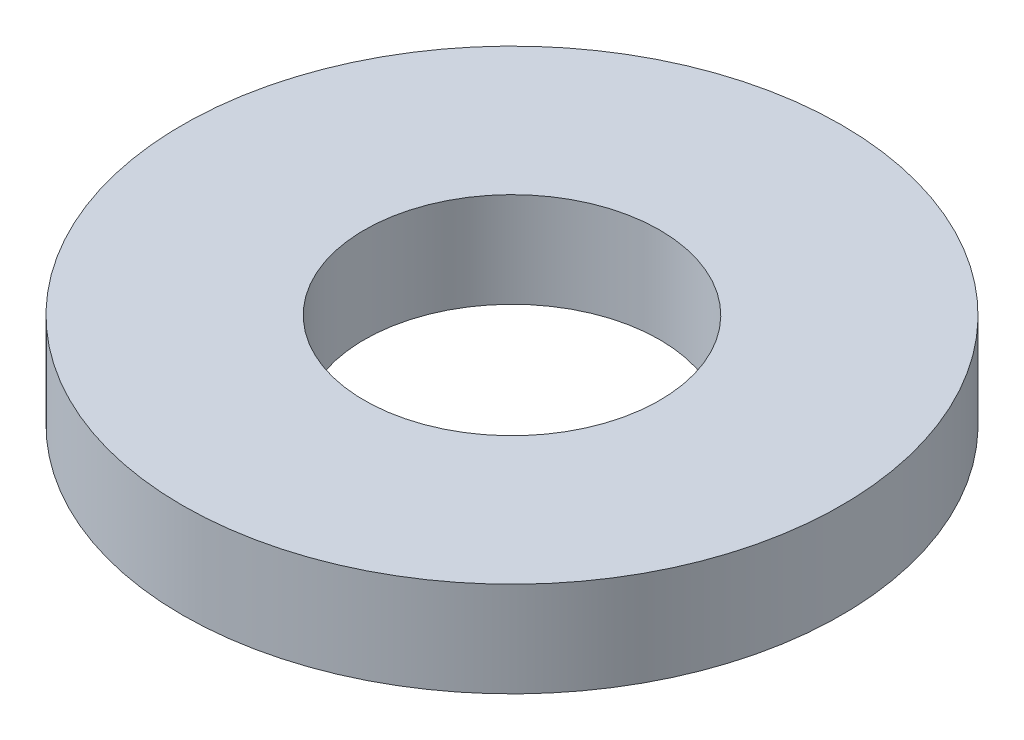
ISO-10303-21;
HEADER;
FILE_DESCRIPTION(('STEP AP214'),'2;1');
FILE_NAME('part.step','',(''),(''),'','','');
FILE_SCHEMA(('AUTOMOTIVE_DESIGN { 1 0 10303 214 1 1 1 1 }'));
ENDSEC;
DATA;
#1=APPLICATION_CONTEXT('core data for automotive mechanical design processes');
#2=APPLICATION_PROTOCOL_DEFINITION('international standard','automotive_design',2000,#1);
#3=PRODUCT_CONTEXT('',#1,'mechanical');
#4=PRODUCT('Part','Part','',(#3));
#5=PRODUCT_RELATED_PRODUCT_CATEGORY('part','',(#4));
#6=PRODUCT_DEFINITION_FORMATION('','',#4);
#7=PRODUCT_DEFINITION_CONTEXT('part definition',#1,'design');
#8=PRODUCT_DEFINITION('design','',#6,#7);
#9=PRODUCT_DEFINITION_SHAPE('','',#8);
#10=(LENGTH_UNIT() NAMED_UNIT(*) SI_UNIT(.MILLI.,.METRE.));
#11=(NAMED_UNIT(*) PLANE_ANGLE_UNIT() SI_UNIT($,.RADIAN.));
#12=(NAMED_UNIT(*) SI_UNIT($,.STERADIAN.) SOLID_ANGLE_UNIT());
#13=UNCERTAINTY_MEASURE_WITH_UNIT(LENGTH_MEASURE(1.E-05),#10,'distance_accuracy_value','');
#14=(GEOMETRIC_REPRESENTATION_CONTEXT(3) GLOBAL_UNCERTAINTY_ASSIGNED_CONTEXT((#13)) GLOBAL_UNIT_ASSIGNED_CONTEXT((#10,
#11,#12)) REPRESENTATION_CONTEXT('',''));
#15=CARTESIAN_POINT('',(0.,0.,0.));
#16=DIRECTION('',(0.,0.,1.));
#17=DIRECTION('',(1.,0.,0.));
#18=AXIS2_PLACEMENT_3D('',#15,#16,#17);
#19=CARTESIAN_POINT('',(0.,1.02108,0.));
#20=DIRECTION('',(0.,-1.,0.));
#21=DIRECTION('',(0.,0.,-1.));
#22=AXIS2_PLACEMENT_3D('',#19,#20,#21);
#23=CYLINDRICAL_SURFACE('',#22,3.5433);
#24=CARTESIAN_POINT('',(0.,1.02108,0.));
#25=DIRECTION('',(0.,1.,0.));
#26=DIRECTION('',(0.,0.,1.));
#27=AXIS2_PLACEMENT_3D('',#24,#25,#26);
#28=CIRCLE('',#27,3.5433);
#29=CARTESIAN_POINT('',(0.,1.02108,-3.5433));
#30=VERTEX_POINT('',#29);
#31=EDGE_CURVE('E10',#30,#30,#28,.T.);
#32=CARTESIAN_POINT('',(0.,0.,0.));
#33=DIRECTION('',(0.,1.,0.));
#34=DIRECTION('',(0.,0.,1.));
#35=AXIS2_PLACEMENT_3D('',#32,#33,#34);
#36=CIRCLE('',#35,3.5433);
#37=CARTESIAN_POINT('',(0.,0.,-3.5433));
#38=VERTEX_POINT('',#37);
#39=EDGE_CURVE('E34',#38,#38,#36,.T.);
#40=CARTESIAN_POINT('',(0.,1.02108,-3.5433));
#41=CARTESIAN_POINT('',(0.,1.01044375,-3.5433));
#42=CARTESIAN_POINT('',(0.,0.9998075,-3.5433));
#43=CARTESIAN_POINT('',(0.,0.978535,-3.5433));
#44=CARTESIAN_POINT('',(0.,0.96789875,-3.5433));
#45=CARTESIAN_POINT('',(0.,0.94662625,-3.5433));
#46=CARTESIAN_POINT('',(0.,0.93599,-3.5433));
#47=CARTESIAN_POINT('',(0.,0.9147175,-3.5433));
#48=CARTESIAN_POINT('',(0.,0.90408125,-3.5433));
#49=CARTESIAN_POINT('',(0.,0.88280875,-3.5433));
#50=CARTESIAN_POINT('',(0.,0.8721725,-3.5433));
#51=CARTESIAN_POINT('',(0.,0.8509,-3.5433));
#52=CARTESIAN_POINT('',(0.,0.84026375,-3.5433));
#53=CARTESIAN_POINT('',(0.,0.81899125,-3.5433));
#54=CARTESIAN_POINT('',(0.,0.808355,-3.5433));
#55=CARTESIAN_POINT('',(0.,0.7870825,-3.5433));
#56=CARTESIAN_POINT('',(0.,0.77644625,-3.5433));
#57=CARTESIAN_POINT('',(0.,0.75517375,-3.5433));
#58=CARTESIAN_POINT('',(0.,0.7445375,-3.5433));
#59=CARTESIAN_POINT('',(0.,0.723265,-3.5433));
#60=CARTESIAN_POINT('',(0.,0.71262875,-3.5433));
#61=CARTESIAN_POINT('',(0.,0.69135625,-3.5433));
#62=CARTESIAN_POINT('',(0.,0.68072,-3.5433));
#63=CARTESIAN_POINT('',(0.,0.6594475,-3.5433));
#64=CARTESIAN_POINT('',(0.,0.64881125,-3.5433));
#65=CARTESIAN_POINT('',(0.,0.62753875,-3.5433));
#66=CARTESIAN_POINT('',(0.,0.6169025,-3.5433));
#67=CARTESIAN_POINT('',(0.,0.59563,-3.5433));
#68=CARTESIAN_POINT('',(0.,0.58499375,-3.5433));
#69=CARTESIAN_POINT('',(0.,0.56372125,-3.5433));
#70=CARTESIAN_POINT('',(0.,0.553085,-3.5433));
#71=CARTESIAN_POINT('',(0.,0.5318125,-3.5433));
#72=CARTESIAN_POINT('',(0.,0.52117625,-3.5433));
#73=CARTESIAN_POINT('',(0.,0.49990375,-3.5433));
#74=CARTESIAN_POINT('',(0.,0.4892675,-3.5433));
#75=CARTESIAN_POINT('',(0.,0.467995,-3.5433));
#76=CARTESIAN_POINT('',(0.,0.45735875,-3.5433));
#77=CARTESIAN_POINT('',(0.,0.43608625,-3.5433));
#78=CARTESIAN_POINT('',(0.,0.42545,-3.5433));
#79=CARTESIAN_POINT('',(0.,0.4041775,-3.5433));
#80=CARTESIAN_POINT('',(0.,0.39354125,-3.5433));
#81=CARTESIAN_POINT('',(0.,0.37226875,-3.5433));
#82=CARTESIAN_POINT('',(0.,0.3616325,-3.5433));
#83=CARTESIAN_POINT('',(0.,0.34036,-3.5433));
#84=CARTESIAN_POINT('',(0.,0.32972375,-3.5433));
#85=CARTESIAN_POINT('',(0.,0.30845125,-3.5433));
#86=CARTESIAN_POINT('',(0.,0.297815,-3.5433));
#87=CARTESIAN_POINT('',(0.,0.2765425,-3.5433));
#88=CARTESIAN_POINT('',(0.,0.26590625,-3.5433));
#89=CARTESIAN_POINT('',(0.,0.24463375,-3.5433));
#90=CARTESIAN_POINT('',(0.,0.2339975,-3.5433));
#91=CARTESIAN_POINT('',(0.,0.212725,-3.5433));
#92=CARTESIAN_POINT('',(0.,0.20208875,-3.5433));
#93=CARTESIAN_POINT('',(0.,0.18081625,-3.5433));
#94=CARTESIAN_POINT('',(0.,0.17018,-3.5433));
#95=CARTESIAN_POINT('',(0.,0.1489075,-3.5433));
#96=CARTESIAN_POINT('',(0.,0.13827125,-3.5433));
#97=CARTESIAN_POINT('',(0.,0.11699875,-3.5433));
#98=CARTESIAN_POINT('',(0.,0.1063625,-3.5433));
#99=CARTESIAN_POINT('',(0.,0.0850899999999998,-3.5433));
#100=CARTESIAN_POINT('',(0.,0.0744537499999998,-3.5433));
#101=CARTESIAN_POINT('',(0.,0.0531812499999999,-3.5433));
#102=CARTESIAN_POINT('',(0.,0.042545,-3.5433));
#103=CARTESIAN_POINT('',(0.,0.0212725,-3.5433));
#104=CARTESIAN_POINT('',(0.,0.01063625,-3.5433));
#105=CARTESIAN_POINT('',(0.,0.,-3.5433));
#106=B_SPLINE_CURVE_WITH_KNOTS('',3,(#40,#41,#42,#43,#44,#45,#46,#47,#48,#49,#50,#51,#52,#53,
#54,#55,#56,#57,#58,#59,#60,#61,#62,#63,#64,#65,#66,#67,#68,#69,#70,#71,#72,#73,#74,#75,#76,#77,
#78,#79,#80,#81,#82,#83,#84,#85,#86,#87,#88,#89,#90,#91,#92,#93,#94,#95,#96,#97,#98,#99,#100,
#101,#102,#103,#104,#105),.UNSPECIFIED.,.F.,.F.,(4,2,2,2,2,2,2,2,2,2,2,2,2,2,2,2,2,2,2,2,2,2,2,
2,2,2,2,2,2,2,2,2,4),(0.,0.03190875,0.0638175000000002,0.0957262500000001,0.127635,0.15954375,
0.1914525,0.22336125,0.25527,0.28717875,0.3190875,0.35099625,0.382905,0.41481375,0.4467225,
0.47863125,0.51054,0.54244875,0.5743575,0.60626625,0.638175,0.67008375,0.7019925,0.73390125,
0.76581,0.79771875,0.8296275,0.86153625,0.893445,0.92535375,0.9572625,0.98917125,1.02108),.UNSPECIFIED.);
#107=EDGE_CURVE('BSEAM28',#30,#38,#106,.T.);
#108=ORIENTED_EDGE('',*,*,#31,.F.);
#109=ORIENTED_EDGE('',*,*,#39,.T.);
#110=ORIENTED_EDGE('',*,*,#107,.T.);
#111=ORIENTED_EDGE('',*,*,#107,.F.);
#112=EDGE_LOOP('',(#108,#110,#109,#111));
#113=FACE_BOUND('',#112,.T.);
#114=ADVANCED_FACE('F28',(#113),#23,.T.);
#115=CARTESIAN_POINT('',(0.,1.02108,0.));
#116=DIRECTION('',(0.,1.,0.));
#117=DIRECTION('',(0.,0.,1.));
#118=AXIS2_PLACEMENT_3D('',#115,#116,#117);
#119=PLANE('',#118);
#120=CARTESIAN_POINT('',(0.,1.02108,0.));
#121=DIRECTION('',(0.,-1.,0.));
#122=DIRECTION('',(0.,0.,-1.));
#123=AXIS2_PLACEMENT_3D('',#120,#121,#122);
#124=CIRCLE('',#123,1.5875);
#125=CARTESIAN_POINT('',(0.,1.02108,-1.5875));
#126=VERTEX_POINT('',#125);
#127=EDGE_CURVE('E38',#126,#126,#124,.T.);
#128=ORIENTED_EDGE('',*,*,#127,.T.);
#129=EDGE_LOOP('',(#128));
#130=FACE_BOUND('',#129,.T.);
#131=ORIENTED_EDGE('',*,*,#31,.T.);
#132=EDGE_LOOP('',(#131));
#133=FACE_BOUND('',#132,.T.);
#134=ADVANCED_FACE('F53',(#130,#133),#119,.T.);
#135=CARTESIAN_POINT('',(0.,0.,0.));
#136=DIRECTION('',(0.,1.,0.));
#137=DIRECTION('',(0.,0.,1.));
#138=AXIS2_PLACEMENT_3D('',#135,#136,#137);
#139=PLANE('',#138);
#140=CARTESIAN_POINT('',(0.,0.,0.));
#141=DIRECTION('',(0.,-1.,0.));
#142=DIRECTION('',(0.,0.,-1.));
#143=AXIS2_PLACEMENT_3D('',#140,#141,#142);
#144=CIRCLE('',#143,1.5875);
#145=CARTESIAN_POINT('',(0.,0.,-1.5875));
#146=VERTEX_POINT('',#145);
#147=EDGE_CURVE('E42',#146,#146,#144,.T.);
#148=ORIENTED_EDGE('',*,*,#147,.F.);
#149=EDGE_LOOP('',(#148));
#150=FACE_BOUND('',#149,.T.);
#151=ORIENTED_EDGE('',*,*,#39,.F.);
#152=EDGE_LOOP('',(#151));
#153=FACE_BOUND('',#152,.T.);
#154=ADVANCED_FACE('F50',(#150,#153),#139,.F.);
#155=CARTESIAN_POINT('',(0.,1.02108,0.));
#156=DIRECTION('',(0.,-1.,0.));
#157=DIRECTION('',(0.,0.,-1.));
#158=AXIS2_PLACEMENT_3D('',#155,#156,#157);
#159=CYLINDRICAL_SURFACE('',#158,1.5875);
#160=CARTESIAN_POINT('',(0.,1.02108,-1.5875));
#161=CARTESIAN_POINT('',(0.,1.01044375,-1.5875));
#162=CARTESIAN_POINT('',(0.,0.9998075,-1.5875));
#163=CARTESIAN_POINT('',(0.,0.978535,-1.5875));
#164=CARTESIAN_POINT('',(0.,0.96789875,-1.5875));
#165=CARTESIAN_POINT('',(0.,0.94662625,-1.5875));
#166=CARTESIAN_POINT('',(0.,0.93599,-1.5875));
#167=CARTESIAN_POINT('',(0.,0.9147175,-1.5875));
#168=CARTESIAN_POINT('',(0.,0.90408125,-1.5875));
#169=CARTESIAN_POINT('',(0.,0.88280875,-1.5875));
#170=CARTESIAN_POINT('',(0.,0.8721725,-1.5875));
#171=CARTESIAN_POINT('',(0.,0.8509,-1.5875));
#172=CARTESIAN_POINT('',(0.,0.84026375,-1.5875));
#173=CARTESIAN_POINT('',(0.,0.81899125,-1.5875));
#174=CARTESIAN_POINT('',(0.,0.808355,-1.5875));
#175=CARTESIAN_POINT('',(0.,0.7870825,-1.5875));
#176=CARTESIAN_POINT('',(0.,0.77644625,-1.5875));
#177=CARTESIAN_POINT('',(0.,0.75517375,-1.5875));
#178=CARTESIAN_POINT('',(0.,0.7445375,-1.5875));
#179=CARTESIAN_POINT('',(0.,0.723265,-1.5875));
#180=CARTESIAN_POINT('',(0.,0.71262875,-1.5875));
#181=CARTESIAN_POINT('',(0.,0.69135625,-1.5875));
#182=CARTESIAN_POINT('',(0.,0.68072,-1.5875));
#183=CARTESIAN_POINT('',(0.,0.6594475,-1.5875));
#184=CARTESIAN_POINT('',(0.,0.64881125,-1.5875));
#185=CARTESIAN_POINT('',(0.,0.62753875,-1.5875));
#186=CARTESIAN_POINT('',(0.,0.6169025,-1.5875));
#187=CARTESIAN_POINT('',(0.,0.59563,-1.5875));
#188=CARTESIAN_POINT('',(0.,0.58499375,-1.5875));
#189=CARTESIAN_POINT('',(0.,0.56372125,-1.5875));
#190=CARTESIAN_POINT('',(0.,0.553085,-1.5875));
#191=CARTESIAN_POINT('',(0.,0.5318125,-1.5875));
#192=CARTESIAN_POINT('',(0.,0.52117625,-1.5875));
#193=CARTESIAN_POINT('',(0.,0.49990375,-1.5875));
#194=CARTESIAN_POINT('',(0.,0.4892675,-1.5875));
#195=CARTESIAN_POINT('',(0.,0.467995,-1.5875));
#196=CARTESIAN_POINT('',(0.,0.45735875,-1.5875));
#197=CARTESIAN_POINT('',(0.,0.43608625,-1.5875));
#198=CARTESIAN_POINT('',(0.,0.42545,-1.5875));
#199=CARTESIAN_POINT('',(0.,0.4041775,-1.5875));
#200=CARTESIAN_POINT('',(0.,0.39354125,-1.5875));
#201=CARTESIAN_POINT('',(0.,0.37226875,-1.5875));
#202=CARTESIAN_POINT('',(0.,0.3616325,-1.5875));
#203=CARTESIAN_POINT('',(0.,0.34036,-1.5875));
#204=CARTESIAN_POINT('',(0.,0.32972375,-1.5875));
#205=CARTESIAN_POINT('',(0.,0.30845125,-1.5875));
#206=CARTESIAN_POINT('',(0.,0.297815,-1.5875));
#207=CARTESIAN_POINT('',(0.,0.2765425,-1.5875));
#208=CARTESIAN_POINT('',(0.,0.26590625,-1.5875));
#209=CARTESIAN_POINT('',(0.,0.24463375,-1.5875));
#210=CARTESIAN_POINT('',(0.,0.2339975,-1.5875));
#211=CARTESIAN_POINT('',(0.,0.212725,-1.5875));
#212=CARTESIAN_POINT('',(0.,0.20208875,-1.5875));
#213=CARTESIAN_POINT('',(0.,0.18081625,-1.5875));
#214=CARTESIAN_POINT('',(0.,0.17018,-1.5875));
#215=CARTESIAN_POINT('',(0.,0.1489075,-1.5875));
#216=CARTESIAN_POINT('',(0.,0.13827125,-1.5875));
#217=CARTESIAN_POINT('',(0.,0.11699875,-1.5875));
#218=CARTESIAN_POINT('',(0.,0.1063625,-1.5875));
#219=CARTESIAN_POINT('',(0.,0.0850900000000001,-1.5875));
#220=CARTESIAN_POINT('',(0.,0.07445375,-1.5875));
#221=CARTESIAN_POINT('',(0.,0.05318125,-1.5875));
#222=CARTESIAN_POINT('',(0.,0.042545,-1.5875));
#223=CARTESIAN_POINT('',(0.,0.0212725,-1.5875));
#224=CARTESIAN_POINT('',(0.,0.01063625,-1.5875));
#225=CARTESIAN_POINT('',(0.,0.,-1.5875));
#226=B_SPLINE_CURVE_WITH_KNOTS('',3,(#160,#161,#162,#163,#164,#165,#166,#167,#168,#169,#170,
#171,#172,#173,#174,#175,#176,#177,#178,#179,#180,#181,#182,#183,#184,#185,#186,#187,#188,#189,
#190,#191,#192,#193,#194,#195,#196,#197,#198,#199,#200,#201,#202,#203,#204,#205,#206,#207,#208,
#209,#210,#211,#212,#213,#214,#215,#216,#217,#218,#219,#220,#221,#222,#223,#224,#225),
.UNSPECIFIED.,.F.,.F.,(4,2,2,2,2,2,2,2,2,2,2,2,2,2,2,2,2,2,2,2,2,2,2,2,2,2,2,2,2,2,2,2,4),(0.,
0.0319087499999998,0.0638174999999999,0.0957262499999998,0.127635,0.15954375,0.1914525,
0.22336125,0.25527,0.28717875,0.3190875,0.35099625,0.382905,0.41481375,0.4467225,0.47863125,
0.51054,0.54244875,0.5743575,0.60626625,0.638175,0.67008375,0.7019925,0.73390125,0.76581,
0.79771875,0.8296275,0.86153625,0.893445,0.92535375,0.9572625,0.98917125,1.02108),.UNSPECIFIED.);
#227=EDGE_CURVE('BSEAM48',#126,#146,#226,.T.);
#228=ORIENTED_EDGE('',*,*,#127,.F.);
#229=ORIENTED_EDGE('',*,*,#147,.T.);
#230=ORIENTED_EDGE('',*,*,#227,.T.);
#231=ORIENTED_EDGE('',*,*,#227,.F.);
#232=EDGE_LOOP('',(#228,#230,#229,#231));
#233=FACE_BOUND('',#232,.T.);
#234=ADVANCED_FACE('F48',(#233),#159,.F.);
#235=CLOSED_SHELL('',(#114,#134,#154,#234));
#236=MANIFOLD_SOLID_BREP('B2',#235);
#237=ADVANCED_BREP_SHAPE_REPRESENTATION('',(#18,#236),#14);
#238=SHAPE_DEFINITION_REPRESENTATION(#9,#237);
ENDSEC;
END-ISO-10303-21;
